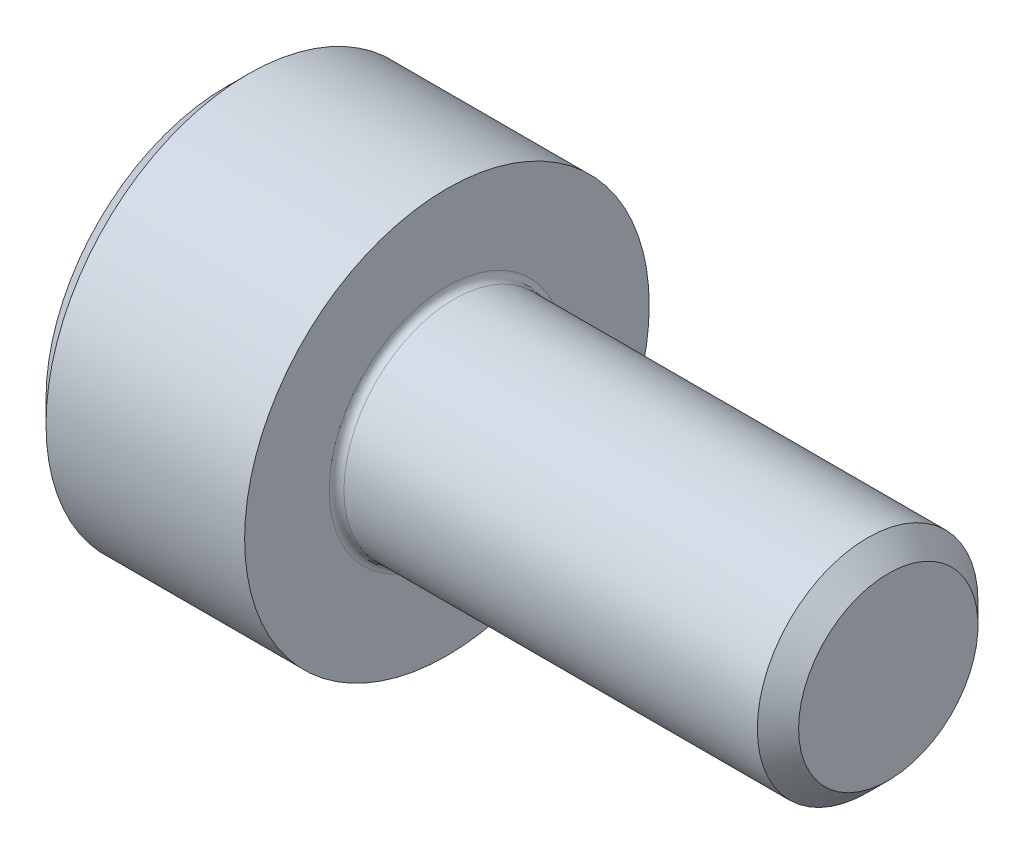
ISO-10303-21;
HEADER;
FILE_DESCRIPTION(('STEP AP214'),'2;1');
FILE_NAME('part.step','',(''),(''),'','','');
FILE_SCHEMA(('AUTOMOTIVE_DESIGN { 1 0 10303 214 1 1 1 1 }'));
ENDSEC;
DATA;
#1=APPLICATION_CONTEXT('core data for automotive mechanical design processes');
#2=APPLICATION_PROTOCOL_DEFINITION('international standard','automotive_design',2000,#1);
#3=PRODUCT_CONTEXT('',#1,'mechanical');
#4=PRODUCT('Part','Part','',(#3));
#5=PRODUCT_RELATED_PRODUCT_CATEGORY('part','',(#4));
#6=PRODUCT_DEFINITION_FORMATION('','',#4);
#7=PRODUCT_DEFINITION_CONTEXT('part definition',#1,'design');
#8=PRODUCT_DEFINITION('design','',#6,#7);
#9=PRODUCT_DEFINITION_SHAPE('','',#8);
#10=(LENGTH_UNIT() NAMED_UNIT(*) SI_UNIT(.MILLI.,.METRE.));
#11=(NAMED_UNIT(*) PLANE_ANGLE_UNIT() SI_UNIT($,.RADIAN.));
#12=(NAMED_UNIT(*) SI_UNIT($,.STERADIAN.) SOLID_ANGLE_UNIT());
#13=UNCERTAINTY_MEASURE_WITH_UNIT(LENGTH_MEASURE(1.E-05),#10,'distance_accuracy_value','');
#14=(GEOMETRIC_REPRESENTATION_CONTEXT(3) GLOBAL_UNCERTAINTY_ASSIGNED_CONTEXT((#13)) GLOBAL_UNIT_ASSIGNED_CONTEXT((#10,
#11,#12)) REPRESENTATION_CONTEXT('',''));
#15=CARTESIAN_POINT('',(0.,0.,0.));
#16=DIRECTION('',(0.,0.,1.));
#17=DIRECTION('',(1.,0.,0.));
#18=AXIS2_PLACEMENT_3D('',#15,#16,#17);
#19=CARTESIAN_POINT('',(0.,0.,0.));
#20=DIRECTION('',(-1.,0.,0.));
#21=DIRECTION('',(0.,0.,1.));
#22=AXIS2_PLACEMENT_3D('',#19,#20,#21);
#23=PLANE('',#22);
#24=DIRECTION('',(0.,-0.499999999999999,0.866025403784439));
#25=VECTOR('',#24,1.);
#26=CARTESIAN_POINT('',(0.,1.47801668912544,0.));
#27=LINE('',#26,#25);
#28=CARTESIAN_POINT('',(0.,1.47801668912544,0.));
#29=VERTEX_POINT('',#28);
#30=CARTESIAN_POINT('',(0.,0.739008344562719,1.28));
#31=VERTEX_POINT('',#30);
#32=EDGE_CURVE('E261',#29,#31,#27,.T.);
#33=ORIENTED_EDGE('',*,*,#32,.T.);
#34=DIRECTION('',(0.,1.,0.));
#35=VECTOR('',#34,1.);
#36=CARTESIAN_POINT('',(0.,-0.739008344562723,1.28));
#37=LINE('',#36,#35);
#38=CARTESIAN_POINT('',(0.,-0.739008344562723,1.28));
#39=VERTEX_POINT('',#38);
#40=EDGE_CURVE('E132',#39,#31,#37,.T.);
#41=ORIENTED_EDGE('',*,*,#40,.F.);
#42=DIRECTION('',(0.,-0.500000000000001,-0.866025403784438));
#43=VECTOR('',#42,1.);
#44=CARTESIAN_POINT('',(0.,-0.739008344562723,1.28));
#45=LINE('',#44,#43);
#46=CARTESIAN_POINT('',(0.,-1.47801668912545,0.));
#47=VERTEX_POINT('',#46);
#48=EDGE_CURVE('E264',#39,#47,#45,.T.);
#49=ORIENTED_EDGE('',*,*,#48,.T.);
#50=DIRECTION('',(0.,0.499999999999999,-0.866025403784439));
#51=VECTOR('',#50,1.);
#52=CARTESIAN_POINT('',(0.,-1.47801668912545,0.));
#53=LINE('',#52,#51);
#54=CARTESIAN_POINT('',(0.,-0.739008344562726,-1.28));
#55=VERTEX_POINT('',#54);
#56=EDGE_CURVE('E267',#47,#55,#53,.T.);
#57=ORIENTED_EDGE('',*,*,#56,.T.);
#58=DIRECTION('',(0.,-1.,0.));
#59=VECTOR('',#58,1.);
#60=CARTESIAN_POINT('',(0.,0.739008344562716,-1.28));
#61=LINE('',#60,#59);
#62=CARTESIAN_POINT('',(0.,0.739008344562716,-1.28));
#63=VERTEX_POINT('',#62);
#64=EDGE_CURVE('E270',#63,#55,#61,.T.);
#65=ORIENTED_EDGE('',*,*,#64,.F.);
#66=DIRECTION('',(0.,-0.500000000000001,-0.866025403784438));
#67=VECTOR('',#66,1.);
#68=CARTESIAN_POINT('',(0.,1.47801668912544,0.));
#69=LINE('',#68,#67);
#70=EDGE_CURVE('E127',#29,#63,#69,.T.);
#71=ORIENTED_EDGE('',*,*,#70,.F.);
#72=EDGE_LOOP('',(#33,#41,#49,#57,#65,#71));
#73=FACE_BOUND('',#72,.T.);
#74=CARTESIAN_POINT('',(0.,0.,0.));
#75=DIRECTION('',(-1.,0.,0.));
#76=DIRECTION('',(0.,0.,1.));
#77=AXIS2_PLACEMENT_3D('',#74,#75,#76);
#78=CIRCLE('',#77,2.45);
#79=CARTESIAN_POINT('',(0.,0.,2.45));
#80=VERTEX_POINT('',#79);
#81=EDGE_CURVE('E156',#80,#80,#78,.T.);
#82=ORIENTED_EDGE('',*,*,#81,.T.);
#83=EDGE_LOOP('',(#82));
#84=FACE_BOUND('',#83,.T.);
#85=ADVANCED_FACE('F36',(#73,#84),#23,.T.);
#86=CARTESIAN_POINT('',(0.,0.,0.));
#87=DIRECTION('',(1.,0.,0.));
#88=DIRECTION('',(0.,0.,-1.));
#89=AXIS2_PLACEMENT_3D('',#86,#87,#88);
#90=CONICAL_SURFACE('',#89,2.45,0.785398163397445);
#91=CARTESIAN_POINT('',(0.300000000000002,0.,0.));
#92=DIRECTION('',(-1.,0.,0.));
#93=DIRECTION('',(0.,0.,1.));
#94=AXIS2_PLACEMENT_3D('',#91,#92,#93);
#95=CIRCLE('',#94,2.75);
#96=CARTESIAN_POINT('',(0.300000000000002,0.,2.75));
#97=VERTEX_POINT('',#96);
#98=EDGE_CURVE('E153',#97,#97,#95,.T.);
#99=ORIENTED_EDGE('',*,*,#98,.T.);
#100=EDGE_LOOP('',(#99));
#101=FACE_BOUND('',#100,.T.);
#102=ORIENTED_EDGE('',*,*,#81,.F.);
#103=EDGE_LOOP('',(#102));
#104=FACE_BOUND('',#103,.T.);
#105=ADVANCED_FACE('F177',(#101,#104),#90,.T.);
#106=CARTESIAN_POINT('',(-31.75,0.,0.));
#107=DIRECTION('',(-1.,0.,0.));
#108=DIRECTION('',(0.,0.,1.));
#109=AXIS2_PLACEMENT_3D('',#106,#107,#108);
#110=CYLINDRICAL_SURFACE('',#109,2.75);
#111=CARTESIAN_POINT('',(3.,0.,0.));
#112=DIRECTION('',(-1.,0.,0.));
#113=DIRECTION('',(0.,0.,1.));
#114=AXIS2_PLACEMENT_3D('',#111,#112,#113);
#115=CIRCLE('',#114,2.75);
#116=CARTESIAN_POINT('',(3.,0.,2.75));
#117=VERTEX_POINT('',#116);
#118=EDGE_CURVE('E150',#117,#117,#115,.T.);
#119=ORIENTED_EDGE('',*,*,#118,.T.);
#120=EDGE_LOOP('',(#119));
#121=FACE_BOUND('',#120,.T.);
#122=ORIENTED_EDGE('',*,*,#98,.F.);
#123=EDGE_LOOP('',(#122));
#124=FACE_BOUND('',#123,.T.);
#125=ADVANCED_FACE('F182',(#121,#124),#110,.T.);
#126=CARTESIAN_POINT('',(3.,2.75,0.));
#127=DIRECTION('',(1.,0.,0.));
#128=DIRECTION('',(0.,0.,-1.));
#129=AXIS2_PLACEMENT_3D('',#126,#127,#128);
#130=PLANE('',#129);
#131=CARTESIAN_POINT('',(3.,0.,0.));
#132=DIRECTION('',(1.,0.,0.));
#133=DIRECTION('',(0.,0.,-1.));
#134=AXIS2_PLACEMENT_3D('',#131,#132,#133);
#135=CIRCLE('',#134,1.6);
#136=CARTESIAN_POINT('',(3.,0.,-1.6));
#137=VERTEX_POINT('',#136);
#138=EDGE_CURVE('E44',#137,#137,#135,.F.);
#139=ORIENTED_EDGE('',*,*,#138,.T.);
#140=EDGE_LOOP('',(#139));
#141=FACE_BOUND('',#140,.T.);
#142=ORIENTED_EDGE('',*,*,#118,.F.);
#143=EDGE_LOOP('',(#142));
#144=FACE_BOUND('',#143,.T.);
#145=ADVANCED_FACE('F161',(#141,#144),#130,.T.);
#146=CARTESIAN_POINT('',(-31.75,0.,0.));
#147=DIRECTION('',(-1.,0.,0.));
#148=DIRECTION('',(0.,0.,1.));
#149=AXIS2_PLACEMENT_3D('',#146,#147,#148);
#150=CYLINDRICAL_SURFACE('',#149,1.5);
#151=CARTESIAN_POINT('',(3.1,0.,0.));
#152=DIRECTION('',(1.,0.,0.));
#153=DIRECTION('',(0.,0.,-1.));
#154=AXIS2_PLACEMENT_3D('',#151,#152,#153);
#155=CIRCLE('',#154,1.5);
#156=CARTESIAN_POINT('',(3.1,0.,-1.5));
#157=VERTEX_POINT('',#156);
#158=EDGE_CURVE('E11',#157,#157,#155,.T.);
#159=ORIENTED_EDGE('',*,*,#158,.T.);
#160=EDGE_LOOP('',(#159));
#161=FACE_BOUND('',#160,.T.);
#162=CARTESIAN_POINT('',(8.71950000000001,0.,0.));
#163=DIRECTION('',(-1.,0.,0.));
#164=DIRECTION('',(0.,0.,1.));
#165=AXIS2_PLACEMENT_3D('',#162,#163,#164);
#166=CIRCLE('',#165,1.5);
#167=CARTESIAN_POINT('',(8.71950000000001,0.,1.5));
#168=VERTEX_POINT('',#167);
#169=EDGE_CURVE('E147',#168,#168,#166,.T.);
#170=ORIENTED_EDGE('',*,*,#169,.T.);
#171=EDGE_LOOP('',(#170));
#172=FACE_BOUND('',#171,.T.);
#173=ADVANCED_FACE('F192',(#161,#172),#150,.T.);
#174=CARTESIAN_POINT('',(9.,0.,0.));
#175=DIRECTION('',(-1.,0.,0.));
#176=DIRECTION('',(0.,0.,1.));
#177=AXIS2_PLACEMENT_3D('',#174,#175,#176);
#178=CONICAL_SURFACE('',#177,1.2195,0.785398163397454);
#179=ORIENTED_EDGE('',*,*,#169,.F.);
#180=EDGE_LOOP('',(#179));
#181=FACE_BOUND('',#180,.T.);
#182=CARTESIAN_POINT('',(9.,0.,0.));
#183=DIRECTION('',(-1.,0.,0.));
#184=DIRECTION('',(0.,0.,1.));
#185=AXIS2_PLACEMENT_3D('',#182,#183,#184);
#186=CIRCLE('',#185,1.2195);
#187=CARTESIAN_POINT('',(9.,0.,1.2195));
#188=VERTEX_POINT('',#187);
#189=EDGE_CURVE('E143',#188,#188,#186,.T.);
#190=ORIENTED_EDGE('',*,*,#189,.T.);
#191=EDGE_LOOP('',(#190));
#192=FACE_BOUND('',#191,.T.);
#193=ADVANCED_FACE('F172',(#181,#192),#178,.T.);
#194=CARTESIAN_POINT('',(9.,1.2195,0.));
#195=DIRECTION('',(1.,0.,0.));
#196=DIRECTION('',(0.,0.,-1.));
#197=AXIS2_PLACEMENT_3D('',#194,#195,#196);
#198=PLANE('',#197);
#199=ORIENTED_EDGE('',*,*,#189,.F.);
#200=EDGE_LOOP('',(#199));
#201=FACE_BOUND('',#200,.T.);
#202=ADVANCED_FACE('F165',(#201),#198,.T.);
#203=CARTESIAN_POINT('',(3.1,0.,0.));
#204=DIRECTION('',(1.,0.,0.));
#205=DIRECTION('',(0.,0.,-1.));
#206=AXIS2_PLACEMENT_3D('',#203,#204,#205);
#207=TOROIDAL_SURFACE('',#206,1.6,0.1);
#208=ORIENTED_EDGE('',*,*,#158,.F.);
#209=EDGE_LOOP('',(#208));
#210=FACE_BOUND('',#209,.T.);
#211=ORIENTED_EDGE('',*,*,#138,.F.);
#212=EDGE_LOOP('',(#211));
#213=FACE_BOUND('',#212,.T.);
#214=ADVANCED_FACE('F38',(#210,#213),#207,.F.);
#215=CARTESIAN_POINT('',(1.3,1.47801668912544,0.));
#216=DIRECTION('',(0.,-0.866025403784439,-0.499999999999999));
#217=DIRECTION('',(0.,0.499999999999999,-0.866025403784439));
#218=AXIS2_PLACEMENT_3D('',#215,#216,#217);
#219=PLANE('',#218);
#220=ORIENTED_EDGE('',*,*,#32,.F.);
#221=DIRECTION('',(-1.,0.,0.));
#222=VECTOR('',#221,1.);
#223=CARTESIAN_POINT('',(1.3,1.47801668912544,0.));
#224=LINE('',#223,#222);
#225=CARTESIAN_POINT('',(1.3,1.47801668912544,0.));
#226=VERTEX_POINT('',#225);
#227=EDGE_CURVE('E251',#226,#29,#224,.T.);
#228=ORIENTED_EDGE('',*,*,#227,.F.);
#229=DIRECTION('',(0.,-0.499999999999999,0.866025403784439));
#230=VECTOR('',#229,1.);
#231=CARTESIAN_POINT('',(1.3,1.47801668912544,0.));
#232=LINE('',#231,#230);
#233=CARTESIAN_POINT('',(1.3,1.10851251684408,0.639999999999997));
#234=VERTEX_POINT('',#233);
#235=EDGE_CURVE('E119',#226,#234,#232,.T.);
#236=ORIENTED_EDGE('',*,*,#235,.T.);
#237=CARTESIAN_POINT('',(1.3,0.739008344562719,1.28));
#238=VERTEX_POINT('',#237);
#239=EDGE_CURVE('E110',#234,#238,#232,.T.);
#240=ORIENTED_EDGE('',*,*,#239,.T.);
#241=DIRECTION('',(-1.,0.,0.));
#242=VECTOR('',#241,1.);
#243=CARTESIAN_POINT('',(1.3,0.739008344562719,1.28));
#244=LINE('',#243,#242);
#245=EDGE_CURVE('E124',#238,#31,#244,.T.);
#246=ORIENTED_EDGE('',*,*,#245,.T.);
#247=EDGE_LOOP('',(#220,#228,#236,#240,#246));
#248=FACE_BOUND('',#247,.T.);
#249=ADVANCED_FACE('F123',(#248),#219,.T.);
#250=CARTESIAN_POINT('',(1.3,-0.739008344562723,1.28));
#251=DIRECTION('',(0.,0.,1.));
#252=DIRECTION('',(0.,-1.,0.));
#253=AXIS2_PLACEMENT_3D('',#250,#251,#252);
#254=PLANE('',#253);
#255=ORIENTED_EDGE('',*,*,#40,.T.);
#256=ORIENTED_EDGE('',*,*,#245,.F.);
#257=DIRECTION('',(0.,1.,0.));
#258=VECTOR('',#257,1.);
#259=CARTESIAN_POINT('',(1.3,-0.739008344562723,1.28));
#260=LINE('',#259,#258);
#261=CARTESIAN_POINT('',(1.3,0.,1.28));
#262=VERTEX_POINT('',#261);
#263=EDGE_CURVE('E107',#262,#238,#260,.T.);
#264=ORIENTED_EDGE('',*,*,#263,.F.);
#265=CARTESIAN_POINT('',(1.3,-0.739008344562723,1.28));
#266=VERTEX_POINT('',#265);
#267=EDGE_CURVE('E118',#266,#262,#260,.T.);
#268=ORIENTED_EDGE('',*,*,#267,.F.);
#269=DIRECTION('',(-1.,0.,0.));
#270=VECTOR('',#269,1.);
#271=CARTESIAN_POINT('',(1.3,-0.739008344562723,1.28));
#272=LINE('',#271,#270);
#273=EDGE_CURVE('E134',#266,#39,#272,.T.);
#274=ORIENTED_EDGE('',*,*,#273,.T.);
#275=EDGE_LOOP('',(#255,#256,#264,#268,#274));
#276=FACE_BOUND('',#275,.T.);
#277=ADVANCED_FACE('F129',(#276),#254,.F.);
#278=CARTESIAN_POINT('',(1.3,-0.739008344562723,1.28));
#279=DIRECTION('',(0.,0.866025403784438,-0.500000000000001));
#280=DIRECTION('',(0.,0.500000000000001,0.866025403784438));
#281=AXIS2_PLACEMENT_3D('',#278,#279,#280);
#282=PLANE('',#281);
#283=ORIENTED_EDGE('',*,*,#48,.F.);
#284=ORIENTED_EDGE('',*,*,#273,.F.);
#285=DIRECTION('',(0.,-0.500000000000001,-0.866025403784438));
#286=VECTOR('',#285,1.);
#287=CARTESIAN_POINT('',(1.3,-0.739008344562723,1.28));
#288=LINE('',#287,#286);
#289=CARTESIAN_POINT('',(1.3,-1.10851251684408,0.640000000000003));
#290=VERTEX_POINT('',#289);
#291=EDGE_CURVE('E290',#266,#290,#288,.T.);
#292=ORIENTED_EDGE('',*,*,#291,.T.);
#293=CARTESIAN_POINT('',(1.3,-1.47801668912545,0.));
#294=VERTEX_POINT('',#293);
#295=EDGE_CURVE('E279',#290,#294,#288,.T.);
#296=ORIENTED_EDGE('',*,*,#295,.T.);
#297=DIRECTION('',(-1.,0.,0.));
#298=VECTOR('',#297,1.);
#299=CARTESIAN_POINT('',(1.3,-1.47801668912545,0.));
#300=LINE('',#299,#298);
#301=EDGE_CURVE('E139',#294,#47,#300,.T.);
#302=ORIENTED_EDGE('',*,*,#301,.T.);
#303=EDGE_LOOP('',(#283,#284,#292,#296,#302));
#304=FACE_BOUND('',#303,.T.);
#305=ADVANCED_FACE('F205',(#304),#282,.T.);
#306=CARTESIAN_POINT('',(1.3,-1.47801668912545,0.));
#307=DIRECTION('',(0.,0.866025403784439,0.499999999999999));
#308=DIRECTION('',(0.,-0.499999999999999,0.866025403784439));
#309=AXIS2_PLACEMENT_3D('',#306,#307,#308);
#310=PLANE('',#309);
#311=ORIENTED_EDGE('',*,*,#56,.F.);
#312=ORIENTED_EDGE('',*,*,#301,.F.);
#313=DIRECTION('',(0.,0.499999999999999,-0.866025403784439));
#314=VECTOR('',#313,1.);
#315=CARTESIAN_POINT('',(1.3,-1.47801668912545,0.));
#316=LINE('',#315,#314);
#317=CARTESIAN_POINT('',(1.3,-1.10851251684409,-0.640000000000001));
#318=VERTEX_POINT('',#317);
#319=EDGE_CURVE('E257',#294,#318,#316,.T.);
#320=ORIENTED_EDGE('',*,*,#319,.T.);
#321=CARTESIAN_POINT('',(1.3,-0.739008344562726,-1.28));
#322=VERTEX_POINT('',#321);
#323=EDGE_CURVE('E289',#318,#322,#316,.T.);
#324=ORIENTED_EDGE('',*,*,#323,.T.);
#325=DIRECTION('',(-1.,0.,0.));
#326=VECTOR('',#325,1.);
#327=CARTESIAN_POINT('',(1.3,-0.739008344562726,-1.28));
#328=LINE('',#327,#326);
#329=EDGE_CURVE('E250',#322,#55,#328,.T.);
#330=ORIENTED_EDGE('',*,*,#329,.T.);
#331=EDGE_LOOP('',(#311,#312,#320,#324,#330));
#332=FACE_BOUND('',#331,.T.);
#333=ADVANCED_FACE('F208',(#332),#310,.T.);
#334=CARTESIAN_POINT('',(1.3,0.739008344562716,-1.28));
#335=DIRECTION('',(0.,0.,-1.));
#336=DIRECTION('',(0.,1.,0.));
#337=AXIS2_PLACEMENT_3D('',#334,#335,#336);
#338=PLANE('',#337);
#339=ORIENTED_EDGE('',*,*,#64,.T.);
#340=ORIENTED_EDGE('',*,*,#329,.F.);
#341=DIRECTION('',(0.,-1.,0.));
#342=VECTOR('',#341,1.);
#343=CARTESIAN_POINT('',(1.3,0.739008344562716,-1.28));
#344=LINE('',#343,#342);
#345=CARTESIAN_POINT('',(1.3,0.,-1.28));
#346=VERTEX_POINT('',#345);
#347=EDGE_CURVE('E254',#346,#322,#344,.T.);
#348=ORIENTED_EDGE('',*,*,#347,.F.);
#349=CARTESIAN_POINT('',(1.3,0.739008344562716,-1.28));
#350=VERTEX_POINT('',#349);
#351=EDGE_CURVE('E51',#350,#346,#344,.T.);
#352=ORIENTED_EDGE('',*,*,#351,.F.);
#353=DIRECTION('',(-1.,0.,0.));
#354=VECTOR('',#353,1.);
#355=CARTESIAN_POINT('',(1.3,0.739008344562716,-1.28));
#356=LINE('',#355,#354);
#357=EDGE_CURVE('E247',#350,#63,#356,.T.);
#358=ORIENTED_EDGE('',*,*,#357,.T.);
#359=EDGE_LOOP('',(#339,#340,#348,#352,#358));
#360=FACE_BOUND('',#359,.T.);
#361=ADVANCED_FACE('F212',(#360),#338,.F.);
#362=CARTESIAN_POINT('',(1.3,1.47801668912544,0.));
#363=DIRECTION('',(0.,0.866025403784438,-0.500000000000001));
#364=DIRECTION('',(0.,0.500000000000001,0.866025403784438));
#365=AXIS2_PLACEMENT_3D('',#362,#363,#364);
#366=PLANE('',#365);
#367=ORIENTED_EDGE('',*,*,#70,.T.);
#368=ORIENTED_EDGE('',*,*,#357,.F.);
#369=DIRECTION('',(0.,-0.500000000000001,-0.866025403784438));
#370=VECTOR('',#369,1.);
#371=CARTESIAN_POINT('',(1.3,1.47801668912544,0.));
#372=LINE('',#371,#370);
#373=CARTESIAN_POINT('',(1.3,1.10851251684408,-0.640000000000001));
#374=VERTEX_POINT('',#373);
#375=EDGE_CURVE('E237',#374,#350,#372,.T.);
#376=ORIENTED_EDGE('',*,*,#375,.F.);
#377=EDGE_CURVE('E243',#226,#374,#372,.T.);
#378=ORIENTED_EDGE('',*,*,#377,.F.);
#379=ORIENTED_EDGE('',*,*,#227,.T.);
#380=EDGE_LOOP('',(#367,#368,#376,#378,#379));
#381=FACE_BOUND('',#380,.T.);
#382=ADVANCED_FACE('F216',(#381),#366,.F.);
#383=CARTESIAN_POINT('',(1.3,1.47801668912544,0.));
#384=DIRECTION('',(1.,0.,0.));
#385=DIRECTION('',(0.,0.,-1.));
#386=AXIS2_PLACEMENT_3D('',#383,#384,#385);
#387=PLANE('',#386);
#388=ORIENTED_EDGE('',*,*,#347,.T.);
#389=ORIENTED_EDGE('',*,*,#323,.F.);
#390=CARTESIAN_POINT('',(1.3,0.,0.));
#391=DIRECTION('',(-1.,0.,0.));
#392=DIRECTION('',(0.,0.,1.));
#393=AXIS2_PLACEMENT_3D('',#390,#391,#392);
#394=CIRCLE('',#393,1.28);
#395=EDGE_CURVE('E285',#346,#318,#394,.T.);
#396=ORIENTED_EDGE('',*,*,#395,.F.);
#397=EDGE_LOOP('',(#388,#389,#396));
#398=FACE_BOUND('',#397,.T.);
#399=ADVANCED_FACE('F220',(#398),#387,.F.);
#400=ORIENTED_EDGE('',*,*,#319,.F.);
#401=ORIENTED_EDGE('',*,*,#295,.F.);
#402=EDGE_CURVE('E137',#318,#290,#394,.T.);
#403=ORIENTED_EDGE('',*,*,#402,.F.);
#404=EDGE_LOOP('',(#400,#401,#403));
#405=FACE_BOUND('',#404,.T.);
#406=ADVANCED_FACE('F223',(#405),#387,.F.);
#407=ORIENTED_EDGE('',*,*,#291,.F.);
#408=ORIENTED_EDGE('',*,*,#267,.T.);
#409=EDGE_CURVE('E133',#290,#262,#394,.T.);
#410=ORIENTED_EDGE('',*,*,#409,.F.);
#411=EDGE_LOOP('',(#407,#408,#410));
#412=FACE_BOUND('',#411,.T.);
#413=ADVANCED_FACE('F228',(#412),#387,.F.);
#414=ORIENTED_EDGE('',*,*,#263,.T.);
#415=ORIENTED_EDGE('',*,*,#239,.F.);
#416=EDGE_CURVE('E113',#262,#234,#394,.T.);
#417=ORIENTED_EDGE('',*,*,#416,.F.);
#418=EDGE_LOOP('',(#414,#415,#417));
#419=FACE_BOUND('',#418,.T.);
#420=ADVANCED_FACE('F109',(#419),#387,.F.);
#421=ORIENTED_EDGE('',*,*,#235,.F.);
#422=ORIENTED_EDGE('',*,*,#377,.T.);
#423=EDGE_CURVE('E144',#234,#374,#394,.T.);
#424=ORIENTED_EDGE('',*,*,#423,.F.);
#425=EDGE_LOOP('',(#421,#422,#424));
#426=FACE_BOUND('',#425,.T.);
#427=ADVANCED_FACE('F231',(#426),#387,.F.);
#428=ORIENTED_EDGE('',*,*,#375,.T.);
#429=ORIENTED_EDGE('',*,*,#351,.T.);
#430=EDGE_CURVE('E240',#374,#346,#394,.T.);
#431=ORIENTED_EDGE('',*,*,#430,.F.);
#432=EDGE_LOOP('',(#428,#429,#431));
#433=FACE_BOUND('',#432,.T.);
#434=ADVANCED_FACE('F201',(#433),#387,.F.);
#435=CARTESIAN_POINT('',(1.3,0.,0.));
#436=DIRECTION('',(-1.,0.,0.));
#437=DIRECTION('',(0.,0.,1.));
#438=AXIS2_PLACEMENT_3D('',#435,#436,#437);
#439=CONICAL_SURFACE('',#438,1.28,1.0471975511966);
#440=CARTESIAN_POINT('',(2.03900834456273,0.,0.));
#441=VERTEX_POINT('',#440);
#442=VERTEX_LOOP('',#441);
#443=FACE_BOUND('',#442,.T.);
#444=ORIENTED_EDGE('',*,*,#416,.T.);
#445=ORIENTED_EDGE('',*,*,#423,.T.);
#446=ORIENTED_EDGE('',*,*,#430,.T.);
#447=ORIENTED_EDGE('',*,*,#395,.T.);
#448=ORIENTED_EDGE('',*,*,#402,.T.);
#449=ORIENTED_EDGE('',*,*,#409,.T.);
#450=EDGE_LOOP('',(#444,#445,#446,#447,#448,#449));
#451=FACE_BOUND('',#450,.T.);
#452=ADVANCED_FACE('F199',(#443,#451),#439,.F.);
#453=CLOSED_SHELL('',(#85,#105,#125,#145,#173,#193,#202,#214,#249,#277,#305,#333,#361,#382,#399,
#406,#413,#420,#427,#434,#452));
#454=MANIFOLD_SOLID_BREP('B2',#453);
#455=ADVANCED_BREP_SHAPE_REPRESENTATION('',(#18,#454),#14);
#456=SHAPE_DEFINITION_REPRESENTATION(#9,#455);
ENDSEC;
END-ISO-10303-21;
